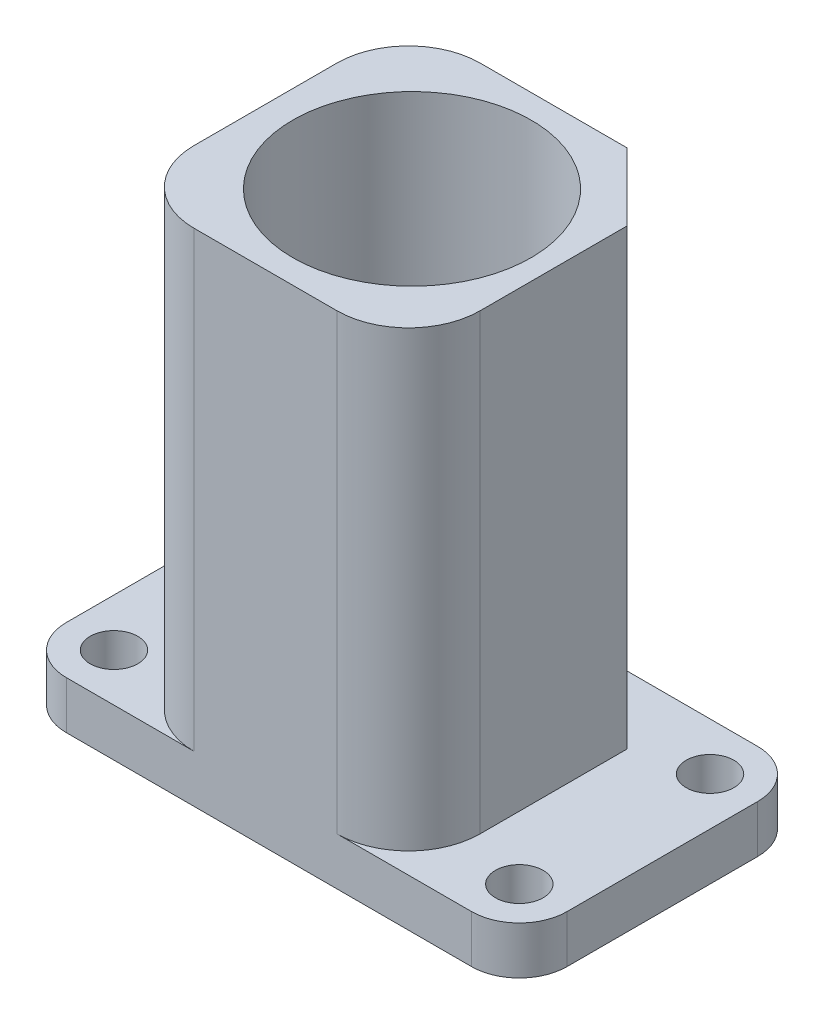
from build123d import *

# Parameters (mm, degrees)
SKETCH1_W           = 8.5
SKETCH1_H           = 6
BOSS_EXTRUDE1_DEPTH = 1
BOSS_EXTRUDE2_DEPTH = 9.5
SKETCH3_R           = 2.5
CUT_EXTRUDE1_DEPTH  = 8.5
SKETCH7_W           = 6
SKETCH7_H           = 1
BOSS_EXTRUDE3_DEPTH = 1
SKETCH13_W          = 6
SKETCH13_H          = 1
BOSS_EXTRUDE4_DEPTH = 1
SKETCH8_R           = 0.5
CUT_EXTRUDE2_DEPTH  = 12.26110563
SKETCH10_W          = 4
SKETCH10_H          = 4
CUT_EXTRUDE3_DEPTH  = 1.3
SKETCH11_R          = 1.75
CUT_EXTRUDE4_DEPTH  = 12.009200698
SKETCH12_R          = 0.5
CUT_EXTRUDE5_DEPTH  = 1.3
FILLET1_R           = 1
FILLET2_R           = 1.5


with BuildPart() as part:
    # Sketch1 → Boss-Extrude1 (new body)
    with BuildSketch(Plane(origin=(0, 0, 0), x_dir=(1, 0, 0), z_dir=(0, 1, 0))):
        Rectangle(SKETCH1_W, SKETCH1_H)
    extrude(amount=BOSS_EXTRUDE1_DEPTH)

    # Sketch2 → Boss-Extrude2 (add)
    with BuildSketch(Plane(origin=(0, 1, 0), x_dir=(1, 0, 0), z_dir=(0, 1, 0))):
        Polygon((1.513231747, 3), (2.927445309, 1.585786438), (2.927445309, -3), (-3.072554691, -3), (-3.072554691, 3), align=None)
    extrude(amount=BOSS_EXTRUDE2_DEPTH)

    # Sketch3 → Cut-Extrude1 (cut)
    with BuildSketch(Plane(origin=(0, 10.5, 0), x_dir=(1, 0, 0), z_dir=(0, 1, 0))):
        with Locations(Location((0, 0, 0), (0, 0, 270))):
            Circle(SKETCH3_R)
    extrude(amount=-CUT_EXTRUDE1_DEPTH, mode=Mode.SUBTRACT)

    # Sketch7 → Boss-Extrude3 (add)
    with BuildSketch(Plane.ZY.offset(4.25)):
        with Locations((0, 0.5)):
            Rectangle(SKETCH7_W, SKETCH7_H)
    extrude(amount=BOSS_EXTRUDE3_DEPTH)

    # Sketch13 → Boss-Extrude4 (add)
    with BuildSketch(Plane(origin=(4.25, 0, 0), x_dir=(0, 0, -1), z_dir=(1, 0, 0))):
        with Locations((0, 0.5)):
            Rectangle(SKETCH13_W, SKETCH13_H)
    extrude(amount=BOSS_EXTRUDE4_DEPTH)

    # Sketch8 → Cut-Extrude2 (cut, through all)
    with BuildSketch(Plane(origin=(0, 1, 0), x_dir=(1, 0, 0), z_dir=(0, 1, 0))):
        with Locations(Location((-4.25, 2, 0), (0, 0, 270))):
            Circle(SKETCH8_R)
        with Locations(Location((-4.25, -2, 0), (0, 0, 270))):
            Circle(SKETCH8_R)
        with Locations(Location((4.25, 2, 0), (0, 0, 270))):
            Circle(SKETCH8_R)
        with Locations(Location((4.25, -2, 0), (0, 0, 270))):
            Circle(SKETCH8_R)
    extrude(amount=-CUT_EXTRUDE2_DEPTH, mode=Mode.SUBTRACT)

    # Sketch10 → Cut-Extrude3 (cut)
    with BuildSketch(Plane.XZ):
        Rectangle(SKETCH10_W, SKETCH10_H)
    extrude(amount=-CUT_EXTRUDE3_DEPTH, mode=Mode.SUBTRACT)

    # Sketch11 → Cut-Extrude4 (cut, through all)
    with BuildSketch(Plane.XZ.offset(-1.3)):
        with Locations(Location((0, 0, 0), (0, 0, 270))):
            Circle(SKETCH11_R)
    extrude(amount=-CUT_EXTRUDE4_DEPTH, mode=Mode.SUBTRACT)

    # Sketch12 → Cut-Extrude5 (cut)
    with BuildSketch(Plane.XZ):
        with Locations((-1.5, 2)):
            Circle(SKETCH12_R)
        with Locations((-2, -1.5)):
            Circle(SKETCH12_R)
        with Locations((1.5, -2)):
            Circle(SKETCH12_R)
        with Locations((2, 1.5)):
            Circle(SKETCH12_R)
    extrude(amount=-CUT_EXTRUDE5_DEPTH, mode=Mode.SUBTRACT)

    # Fillet1
    fillet1_edges = [part.edges().sort_by_distance(p)[0] for p in [
        (-5.25, 0.5, 3),
        (-5.25, 0.5, -3),
        (5.25, 0.5, 3),
        (5.25, 0.5, -3),
    ]]
    fillet(fillet1_edges, radius=FILLET1_R)

    # Fillet2
    fillet2_edges = [part.edges().sort_by_distance(p)[0] for p in [
        (-3.072554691, 5.75, -3),
        (2.927445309, 5.75, 3),
        (-3.072554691, 5.75, 3),
    ]]
    fillet(fillet2_edges, radius=FILLET2_R)


solid = part.part
